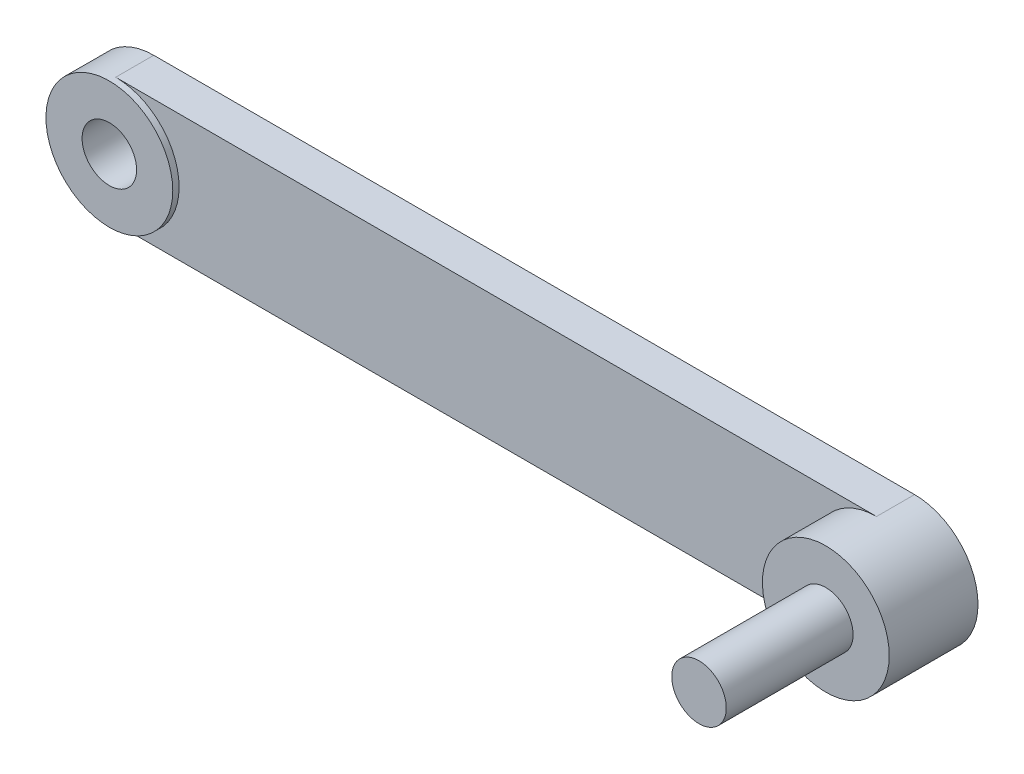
from build123d import *

# Parameters (mm, degrees)
ESQUISSE1_R        = 2.15
BOSS_EXTRU_1_DEPTH = 3
ESQUISSE2_R        = 5
ESQUISSE2_R_2      = 2.15
ESQUISSE2_R_3      = 2.05
BOSS_EXTRU_2_DEPTH = 0.5
ESQUISSE4_R        = 5
ESQUISSE4_R_2      = 2.05
BOSS_EXTRU_3_DEPTH = 3.5
ESQUISSE5_R        = 2.15
BOSS_EXTRU_4_DEPTH = 17


with BuildPart() as part:
    # Esquisse1 → Boss.-Extru.1 (new body)
    with BuildSketch(Plane.XY):
        with BuildLine():
            Line((0, 5), (60, 5))
            ThreePointArc((60, 5), (65, 0), (60, -5))
            Line((60, -5), (0, -5))
            ThreePointArc((0, -5), (-5, 0), (0, 5))
        make_face()
        Circle(ESQUISSE1_R, mode=Mode.SUBTRACT)
        with Locations((60, 0)):
            Circle(ESQUISSE1_R, mode=Mode.SUBTRACT)
    extrude(amount=BOSS_EXTRU_1_DEPTH)

    # Esquisse2 → Boss.-Extru.2 (add)
    # profile 1 of 2: a face of its own
    with BuildSketch(Plane.XY.offset(3)):
        with Locations(Location((0, 0, 0), (0, 0, 270))):
            Circle(ESQUISSE2_R)
        Circle(ESQUISSE2_R_2, mode=Mode.SUBTRACT)
    # profile 2 of 2: a face of its own
    with BuildSketch(Plane.XY.offset(3)):
        with Locations(Location((60, 0, 0), (0, 0, 90))):
            Circle(ESQUISSE2_R)
        with Locations((60, 0)):
            Circle(ESQUISSE2_R_3, mode=Mode.SUBTRACT)
    extrude(amount=BOSS_EXTRU_2_DEPTH)

    # Esquisse4 → Boss.-Extru.3 (add)
    with BuildSketch(Plane.XY.offset(3.5)):
        with Locations(Location((60, 0, 0), (0, 0, 90))):
            Circle(ESQUISSE4_R)
        with Locations((60, 0)):
            Circle(ESQUISSE4_R_2, mode=Mode.SUBTRACT)
    extrude(amount=BOSS_EXTRU_3_DEPTH)

    # Esquisse5 → Boss.-Extru.4 (add)
    with BuildSketch(Plane(origin=(0, 0, 0), x_dir=(-1, 0, 0), z_dir=(0, 0, -1))):
        with Locations((-60, 0)):
            Circle(ESQUISSE5_R)
    extrude(amount=-BOSS_EXTRU_4_DEPTH)


solid = part.part
